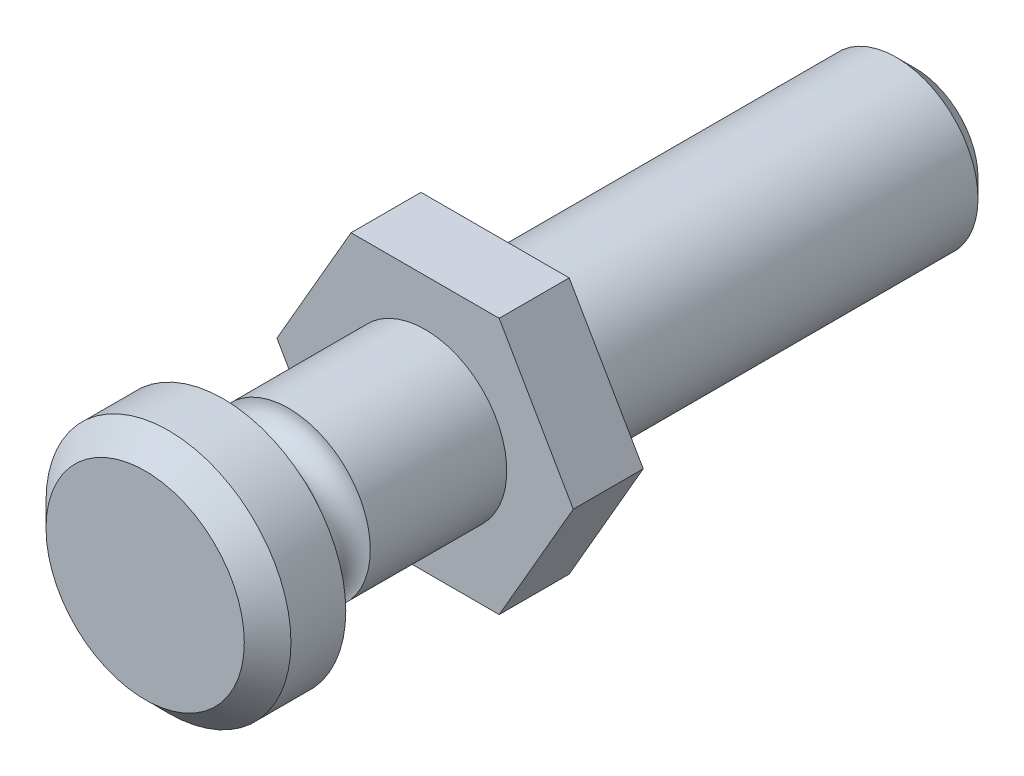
ISO-10303-21;
HEADER;
FILE_DESCRIPTION(('STEP AP214'),'2;1');
FILE_NAME('part.step','',(''),(''),'','','');
FILE_SCHEMA(('AUTOMOTIVE_DESIGN { 1 0 10303 214 1 1 1 1 }'));
ENDSEC;
DATA;
#1=APPLICATION_CONTEXT('core data for automotive mechanical design processes');
#2=APPLICATION_PROTOCOL_DEFINITION('international standard','automotive_design',2000,#1);
#3=PRODUCT_CONTEXT('',#1,'mechanical');
#4=PRODUCT('Part','Part','',(#3));
#5=PRODUCT_RELATED_PRODUCT_CATEGORY('part','',(#4));
#6=PRODUCT_DEFINITION_FORMATION('','',#4);
#7=PRODUCT_DEFINITION_CONTEXT('part definition',#1,'design');
#8=PRODUCT_DEFINITION('design','',#6,#7);
#9=PRODUCT_DEFINITION_SHAPE('','',#8);
#10=(LENGTH_UNIT() NAMED_UNIT(*) SI_UNIT(.MILLI.,.METRE.));
#11=(NAMED_UNIT(*) PLANE_ANGLE_UNIT() SI_UNIT($,.RADIAN.));
#12=(NAMED_UNIT(*) SI_UNIT($,.STERADIAN.) SOLID_ANGLE_UNIT());
#13=UNCERTAINTY_MEASURE_WITH_UNIT(LENGTH_MEASURE(1.E-05),#10,'distance_accuracy_value','');
#14=(GEOMETRIC_REPRESENTATION_CONTEXT(3) GLOBAL_UNCERTAINTY_ASSIGNED_CONTEXT((#13)) GLOBAL_UNIT_ASSIGNED_CONTEXT((#10,
#11,#12)) REPRESENTATION_CONTEXT('',''));
#15=CARTESIAN_POINT('',(0.,0.,0.));
#16=DIRECTION('',(0.,0.,1.));
#17=DIRECTION('',(1.,0.,0.));
#18=AXIS2_PLACEMENT_3D('',#15,#16,#17);
#19=CARTESIAN_POINT('',(2.22044604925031E-13,2.22044604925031E-13,33.9999999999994));
#20=DIRECTION('',(0.,0.,-0.999999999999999));
#21=DIRECTION('',(-1.,0.,0.));
#22=AXIS2_PLACEMENT_3D('',#19,#20,#21);
#23=CYLINDRICAL_SURFACE('',#22,5.25);
#24=CARTESIAN_POINT('',(1.66533453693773E-13,0.,32.));
#25=DIRECTION('',(0.,0.,0.999999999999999));
#26=DIRECTION('',(1.,0.,0.));
#27=AXIS2_PLACEMENT_3D('',#24,#25,#26);
#28=CIRCLE('',#27,5.25);
#29=CARTESIAN_POINT('',(-5.24999999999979,2.21642149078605E-13,32.));
#30=VERTEX_POINT('',#29);
#31=EDGE_CURVE('E11',#30,#30,#28,.F.);
#32=CARTESIAN_POINT('',(0.,-2.22044604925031E-13,29.6499999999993));
#33=DIRECTION('',(0.,0.,0.999999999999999));
#34=DIRECTION('',(1.,0.,0.));
#35=AXIS2_PLACEMENT_3D('',#32,#33,#34);
#36=CIRCLE('',#35,5.25);
#37=CARTESIAN_POINT('',(-5.24999999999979,2.21511697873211E-13,29.6499999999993));
#38=VERTEX_POINT('',#37);
#39=EDGE_CURVE('E250',#38,#38,#36,.T.);
#40=CARTESIAN_POINT('',(-5.24999999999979,2.21642149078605E-13,32.));
#41=CARTESIAN_POINT('',(-5.24999999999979,2.21640790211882E-13,31.9755208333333));
#42=CARTESIAN_POINT('',(-5.24999999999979,2.21639431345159E-13,31.9510416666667));
#43=CARTESIAN_POINT('',(-5.24999999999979,2.21636713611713E-13,31.9020833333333));
#44=CARTESIAN_POINT('',(-5.24999999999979,2.2163535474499E-13,31.8776041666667));
#45=CARTESIAN_POINT('',(-5.24999999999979,2.21632637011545E-13,31.8286458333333));
#46=CARTESIAN_POINT('',(-5.24999999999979,2.21631278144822E-13,31.8041666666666));
#47=CARTESIAN_POINT('',(-5.24999999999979,2.21628560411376E-13,31.7552083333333));
#48=CARTESIAN_POINT('',(-5.24999999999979,2.21627201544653E-13,31.7307291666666));
#49=CARTESIAN_POINT('',(-5.24999999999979,2.21624483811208E-13,31.6817708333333));
#50=CARTESIAN_POINT('',(-5.24999999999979,2.21623124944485E-13,31.6572916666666));
#51=CARTESIAN_POINT('',(-5.24999999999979,2.21620407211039E-13,31.6083333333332));
#52=CARTESIAN_POINT('',(-5.24999999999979,2.21619048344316E-13,31.5838541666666));
#53=CARTESIAN_POINT('',(-5.24999999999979,2.21616330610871E-13,31.5348958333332));
#54=CARTESIAN_POINT('',(-5.24999999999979,2.21614971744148E-13,31.5104166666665));
#55=CARTESIAN_POINT('',(-5.24999999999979,2.21612254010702E-13,31.4614583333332));
#56=CARTESIAN_POINT('',(-5.24999999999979,2.21610895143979E-13,31.4369791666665));
#57=CARTESIAN_POINT('',(-5.24999999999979,2.21608177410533E-13,31.3880208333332));
#58=CARTESIAN_POINT('',(-5.24999999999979,2.21606818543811E-13,31.3635416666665));
#59=CARTESIAN_POINT('',(-5.24999999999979,2.21604100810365E-13,31.3145833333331));
#60=CARTESIAN_POINT('',(-5.24999999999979,2.21602741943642E-13,31.2901041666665));
#61=CARTESIAN_POINT('',(-5.24999999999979,2.21600024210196E-13,31.2411458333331));
#62=CARTESIAN_POINT('',(-5.24999999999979,2.21598665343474E-13,31.2166666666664));
#63=CARTESIAN_POINT('',(-5.24999999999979,2.21595947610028E-13,31.1677083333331));
#64=CARTESIAN_POINT('',(-5.24999999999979,2.21594588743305E-13,31.1432291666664));
#65=CARTESIAN_POINT('',(-5.24999999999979,2.21591871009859E-13,31.0942708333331));
#66=CARTESIAN_POINT('',(-5.24999999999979,2.21590512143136E-13,31.0697916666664));
#67=CARTESIAN_POINT('',(-5.24999999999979,2.21587794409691E-13,31.0208333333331));
#68=CARTESIAN_POINT('',(-5.24999999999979,2.21586435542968E-13,30.9963541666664));
#69=CARTESIAN_POINT('',(-5.24999999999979,2.21583717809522E-13,30.947395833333));
#70=CARTESIAN_POINT('',(-5.24999999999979,2.21582358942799E-13,30.9229166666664));
#71=CARTESIAN_POINT('',(-5.24999999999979,2.21579641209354E-13,30.873958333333));
#72=CARTESIAN_POINT('',(-5.24999999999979,2.21578282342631E-13,30.8494791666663));
#73=CARTESIAN_POINT('',(-5.24999999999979,2.21575564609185E-13,30.800520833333));
#74=CARTESIAN_POINT('',(-5.24999999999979,2.21574205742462E-13,30.7760416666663));
#75=CARTESIAN_POINT('',(-5.24999999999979,2.21571488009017E-13,30.727083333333));
#76=CARTESIAN_POINT('',(-5.24999999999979,2.21570129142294E-13,30.7026041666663));
#77=CARTESIAN_POINT('',(-5.24999999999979,2.21567411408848E-13,30.6536458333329));
#78=CARTESIAN_POINT('',(-5.24999999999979,2.21566052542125E-13,30.6291666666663));
#79=CARTESIAN_POINT('',(-5.24999999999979,2.21563334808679E-13,30.5802083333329));
#80=CARTESIAN_POINT('',(-5.24999999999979,2.21561975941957E-13,30.5557291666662));
#81=CARTESIAN_POINT('',(-5.24999999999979,2.21559258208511E-13,30.5067708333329));
#82=CARTESIAN_POINT('',(-5.24999999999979,2.21557899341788E-13,30.4822916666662));
#83=CARTESIAN_POINT('',(-5.24999999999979,2.21555181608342E-13,30.4333333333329));
#84=CARTESIAN_POINT('',(-5.24999999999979,2.2155382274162E-13,30.4088541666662));
#85=CARTESIAN_POINT('',(-5.24999999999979,2.21551105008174E-13,30.3598958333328));
#86=CARTESIAN_POINT('',(-5.24999999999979,2.21549746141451E-13,30.3354166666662));
#87=CARTESIAN_POINT('',(-5.24999999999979,2.21547028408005E-13,30.2864583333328));
#88=CARTESIAN_POINT('',(-5.24999999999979,2.21545669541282E-13,30.2619791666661));
#89=CARTESIAN_POINT('',(-5.24999999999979,2.21542951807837E-13,30.2130208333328));
#90=CARTESIAN_POINT('',(-5.24999999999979,2.21541592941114E-13,30.1885416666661));
#91=CARTESIAN_POINT('',(-5.24999999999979,2.21538875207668E-13,30.1395833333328));
#92=CARTESIAN_POINT('',(-5.24999999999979,2.21537516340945E-13,30.1151041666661));
#93=CARTESIAN_POINT('',(-5.24999999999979,2.215347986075E-13,30.0661458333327));
#94=CARTESIAN_POINT('',(-5.24999999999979,2.21533439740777E-13,30.0416666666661));
#95=CARTESIAN_POINT('',(-5.24999999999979,2.21530722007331E-13,29.9927083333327));
#96=CARTESIAN_POINT('',(-5.24999999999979,2.21529363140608E-13,29.9682291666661));
#97=CARTESIAN_POINT('',(-5.24999999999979,2.21526645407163E-13,29.9192708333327));
#98=CARTESIAN_POINT('',(-5.24999999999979,2.2152528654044E-13,29.894791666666));
#99=CARTESIAN_POINT('',(-5.24999999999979,2.21522568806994E-13,29.8458333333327));
#100=CARTESIAN_POINT('',(-5.24999999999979,2.21521209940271E-13,29.821354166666));
#101=CARTESIAN_POINT('',(-5.24999999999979,2.21518492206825E-13,29.7723958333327));
#102=CARTESIAN_POINT('',(-5.24999999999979,2.21517133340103E-13,29.747916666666));
#103=CARTESIAN_POINT('',(-5.24999999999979,2.21514415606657E-13,29.6989583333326));
#104=CARTESIAN_POINT('',(-5.24999999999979,2.21513056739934E-13,29.674479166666));
#105=CARTESIAN_POINT('',(-5.24999999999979,2.21511697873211E-13,29.6499999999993));
#106=B_SPLINE_CURVE_WITH_KNOTS('',3,(#40,#41,#42,#43,#44,#45,#46,#47,#48,#49,#50,#51,#52,#53,
#54,#55,#56,#57,#58,#59,#60,#61,#62,#63,#64,#65,#66,#67,#68,#69,#70,#71,#72,#73,#74,#75,#76,#77,
#78,#79,#80,#81,#82,#83,#84,#85,#86,#87,#88,#89,#90,#91,#92,#93,#94,#95,#96,#97,#98,#99,#100,
#101,#102,#103,#104,#105),.UNSPECIFIED.,.F.,.F.,(4,2,2,2,2,2,2,2,2,2,2,2,2,2,2,2,2,2,2,2,2,2,2,
2,2,2,2,2,2,2,2,2,4),(0.,0.0734375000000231,0.146875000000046,0.220312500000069,
0.293750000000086,0.367187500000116,0.440625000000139,0.514062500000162,0.587500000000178,
0.660937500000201,0.734375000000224,0.807812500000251,0.881250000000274,0.954687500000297,
1.02812500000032,1.10156250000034,1.17500000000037,1.24843750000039,1.32187500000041,
1.39531250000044,1.46875000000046,1.54218750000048,1.61562500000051,1.68906250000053,
1.76250000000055,1.83593750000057,1.9093750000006,1.98281250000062,2.05625000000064,
2.12968750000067,2.20312500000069,2.27656250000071,2.35000000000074),.UNSPECIFIED.);
#107=EDGE_CURVE('BSEAM36',#30,#38,#106,.T.);
#108=ORIENTED_EDGE('',*,*,#31,.T.);
#109=ORIENTED_EDGE('',*,*,#39,.T.);
#110=ORIENTED_EDGE('',*,*,#107,.T.);
#111=ORIENTED_EDGE('',*,*,#107,.F.);
#112=EDGE_LOOP('',(#108,#110,#109,#111));
#113=FACE_BOUND('',#112,.T.);
#114=ADVANCED_FACE('F36',(#113),#23,.T.);
#115=CARTESIAN_POINT('',(3.1754264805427,-5.49999999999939,21.0000000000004));
#116=DIRECTION('',(0.,0.,-0.999999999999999));
#117=DIRECTION('',(-1.,0.,0.));
#118=AXIS2_PLACEMENT_3D('',#115,#116,#117);
#119=PLANE('',#118);
#120=DIRECTION('',(0.500000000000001,0.86602540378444,0.));
#121=VECTOR('',#120,1.);
#122=CARTESIAN_POINT('',(3.1754264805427,-5.49999999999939,21.0000000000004));
#123=LINE('',#122,#121);
#124=CARTESIAN_POINT('',(3.1754264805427,-5.49999999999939,21.0000000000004));
#125=VERTEX_POINT('',#124);
#126=CARTESIAN_POINT('',(6.35085296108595,0.,21.0000000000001));
#127=VERTEX_POINT('',#126);
#128=EDGE_CURVE('E128',#125,#127,#123,.T.);
#129=ORIENTED_EDGE('',*,*,#128,.T.);
#130=DIRECTION('',(-0.500000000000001,0.86602540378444,0.));
#131=VECTOR('',#130,1.);
#132=CARTESIAN_POINT('',(6.35085296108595,0.,21.0000000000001));
#133=LINE('',#132,#131);
#134=CARTESIAN_POINT('',(3.17542648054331,5.49999999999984,21.0000000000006));
#135=VERTEX_POINT('',#134);
#136=EDGE_CURVE('E105',#127,#135,#133,.T.);
#137=ORIENTED_EDGE('',*,*,#136,.T.);
#138=DIRECTION('',(-1.,0.,0.));
#139=VECTOR('',#138,1.);
#140=CARTESIAN_POINT('',(3.17542648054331,5.49999999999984,21.0000000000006));
#141=LINE('',#140,#139);
#142=CARTESIAN_POINT('',(-3.17542648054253,5.50000000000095,21.0000000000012));
#143=VERTEX_POINT('',#142);
#144=EDGE_CURVE('E131',#135,#143,#141,.T.);
#145=ORIENTED_EDGE('',*,*,#144,.T.);
#146=DIRECTION('',(-0.500000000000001,-0.86602540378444,0.));
#147=VECTOR('',#146,1.);
#148=CARTESIAN_POINT('',(-3.17542648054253,5.50000000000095,21.0000000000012));
#149=LINE('',#148,#147);
#150=CARTESIAN_POINT('',(-6.35085296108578,0.,20.9999999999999));
#151=VERTEX_POINT('',#150);
#152=EDGE_CURVE('E133',#143,#151,#149,.T.);
#153=ORIENTED_EDGE('',*,*,#152,.T.);
#154=DIRECTION('',(0.500000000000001,-0.86602540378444,0.));
#155=VECTOR('',#154,1.);
#156=CARTESIAN_POINT('',(-6.35085296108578,0.,20.9999999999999));
#157=LINE('',#156,#155);
#158=CARTESIAN_POINT('',(-3.17542648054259,-5.49999999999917,20.9999999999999));
#159=VERTEX_POINT('',#158);
#160=EDGE_CURVE('E56',#151,#159,#157,.T.);
#161=ORIENTED_EDGE('',*,*,#160,.T.);
#162=DIRECTION('',(1.,0.,0.));
#163=VECTOR('',#162,1.);
#164=CARTESIAN_POINT('',(-3.17542648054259,-5.49999999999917,20.9999999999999));
#165=LINE('',#164,#163);
#166=EDGE_CURVE('E51',#159,#125,#165,.T.);
#167=ORIENTED_EDGE('',*,*,#166,.T.);
#168=EDGE_LOOP('',(#129,#137,#145,#153,#161,#167));
#169=FACE_BOUND('',#168,.T.);
#170=CARTESIAN_POINT('',(3.88578058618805E-13,4.44089209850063E-13,21.0000000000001));
#171=DIRECTION('',(0.,0.,-0.999999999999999));
#172=DIRECTION('',(-1.,0.,0.));
#173=AXIS2_PLACEMENT_3D('',#170,#171,#172);
#174=CIRCLE('',#173,3.5);
#175=CARTESIAN_POINT('',(-3.4999999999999,0.,21.0000000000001));
#176=VERTEX_POINT('',#175);
#177=EDGE_CURVE('E150',#176,#176,#174,.F.);
#178=ORIENTED_EDGE('',*,*,#177,.F.);
#179=EDGE_LOOP('',(#178));
#180=FACE_BOUND('',#179,.T.);
#181=ADVANCED_FACE('F178',(#169,#180),#119,.F.);
#182=CARTESIAN_POINT('',(0.,0.,18.0000000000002));
#183=DIRECTION('',(0.,0.,-0.999999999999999));
#184=DIRECTION('',(-1.,0.,0.));
#185=AXIS2_PLACEMENT_3D('',#182,#183,#184);
#186=CYLINDRICAL_SURFACE('',#185,3.5);
#187=CARTESIAN_POINT('',(-1.11022302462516E-13,2.22044604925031E-13,0.800000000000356));
#188=DIRECTION('',(0.,0.,0.999999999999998));
#189=DIRECTION('',(1.,0.,0.));
#190=AXIS2_PLACEMENT_3D('',#187,#188,#189);
#191=CIRCLE('',#190,3.5);
#192=CARTESIAN_POINT('',(-3.49999999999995,0.,0.800000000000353));
#193=VERTEX_POINT('',#192);
#194=EDGE_CURVE('E153',#193,#193,#191,.T.);
#195=CARTESIAN_POINT('',(0.,0.,18.0000000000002));
#196=DIRECTION('',(0.,0.,0.999999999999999));
#197=DIRECTION('',(1.,0.,0.));
#198=AXIS2_PLACEMENT_3D('',#195,#196,#197);
#199=CIRCLE('',#198,3.5);
#200=CARTESIAN_POINT('',(-3.49999999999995,0.,18.0000000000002));
#201=VERTEX_POINT('',#200);
#202=EDGE_CURVE('E108',#201,#201,#199,.T.);
#203=CARTESIAN_POINT('',(-3.49999999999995,0.,0.800000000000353));
#204=CARTESIAN_POINT('',(-3.49999999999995,0.,0.979166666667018));
#205=CARTESIAN_POINT('',(-3.49999999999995,0.,1.15833333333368));
#206=CARTESIAN_POINT('',(-3.49999999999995,0.,1.51666666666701));
#207=CARTESIAN_POINT('',(-3.49999999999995,0.,1.69583333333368));
#208=CARTESIAN_POINT('',(-3.49999999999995,0.,2.05416666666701));
#209=CARTESIAN_POINT('',(-3.49999999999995,0.,2.23333333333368));
#210=CARTESIAN_POINT('',(-3.49999999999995,0.,2.59166666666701));
#211=CARTESIAN_POINT('',(-3.49999999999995,0.,2.77083333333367));
#212=CARTESIAN_POINT('',(-3.49999999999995,0.,3.129166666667));
#213=CARTESIAN_POINT('',(-3.49999999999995,0.,3.30833333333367));
#214=CARTESIAN_POINT('',(-3.49999999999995,0.,3.666666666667));
#215=CARTESIAN_POINT('',(-3.49999999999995,0.,3.84583333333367));
#216=CARTESIAN_POINT('',(-3.49999999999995,0.,4.204166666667));
#217=CARTESIAN_POINT('',(-3.49999999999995,0.,4.38333333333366));
#218=CARTESIAN_POINT('',(-3.49999999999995,0.,4.74166666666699));
#219=CARTESIAN_POINT('',(-3.49999999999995,0.,4.92083333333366));
#220=CARTESIAN_POINT('',(-3.49999999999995,0.,5.27916666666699));
#221=CARTESIAN_POINT('',(-3.49999999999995,0.,5.45833333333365));
#222=CARTESIAN_POINT('',(-3.49999999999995,0.,5.81666666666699));
#223=CARTESIAN_POINT('',(-3.49999999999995,0.,5.99583333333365));
#224=CARTESIAN_POINT('',(-3.49999999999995,0.,6.35416666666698));
#225=CARTESIAN_POINT('',(-3.49999999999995,0.,6.53333333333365));
#226=CARTESIAN_POINT('',(-3.49999999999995,0.,6.89166666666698));
#227=CARTESIAN_POINT('',(-3.49999999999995,0.,7.07083333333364));
#228=CARTESIAN_POINT('',(-3.49999999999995,0.,7.42916666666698));
#229=CARTESIAN_POINT('',(-3.49999999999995,0.,7.60833333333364));
#230=CARTESIAN_POINT('',(-3.49999999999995,0.,7.96666666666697));
#231=CARTESIAN_POINT('',(-3.49999999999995,0.,8.14583333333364));
#232=CARTESIAN_POINT('',(-3.49999999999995,0.,8.50416666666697));
#233=CARTESIAN_POINT('',(-3.49999999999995,0.,8.68333333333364));
#234=CARTESIAN_POINT('',(-3.49999999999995,0.,9.04166666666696));
#235=CARTESIAN_POINT('',(-3.49999999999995,0.,9.22083333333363));
#236=CARTESIAN_POINT('',(-3.49999999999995,0.,9.57916666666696));
#237=CARTESIAN_POINT('',(-3.49999999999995,0.,9.75833333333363));
#238=CARTESIAN_POINT('',(-3.49999999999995,0.,10.116666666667));
#239=CARTESIAN_POINT('',(-3.49999999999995,0.,10.2958333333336));
#240=CARTESIAN_POINT('',(-3.49999999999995,0.,10.654166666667));
#241=CARTESIAN_POINT('',(-3.49999999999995,0.,10.8333333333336));
#242=CARTESIAN_POINT('',(-3.49999999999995,0.,11.191666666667));
#243=CARTESIAN_POINT('',(-3.49999999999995,0.,11.3708333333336));
#244=CARTESIAN_POINT('',(-3.49999999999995,0.,11.7291666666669));
#245=CARTESIAN_POINT('',(-3.49999999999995,0.,11.9083333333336));
#246=CARTESIAN_POINT('',(-3.49999999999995,0.,12.2666666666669));
#247=CARTESIAN_POINT('',(-3.49999999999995,0.,12.4458333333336));
#248=CARTESIAN_POINT('',(-3.49999999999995,0.,12.8041666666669));
#249=CARTESIAN_POINT('',(-3.49999999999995,0.,12.9833333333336));
#250=CARTESIAN_POINT('',(-3.49999999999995,0.,13.3416666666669));
#251=CARTESIAN_POINT('',(-3.49999999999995,0.,13.5208333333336));
#252=CARTESIAN_POINT('',(-3.49999999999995,0.,13.8791666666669));
#253=CARTESIAN_POINT('',(-3.49999999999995,0.,14.0583333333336));
#254=CARTESIAN_POINT('',(-3.49999999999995,0.,14.4166666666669));
#255=CARTESIAN_POINT('',(-3.49999999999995,0.,14.5958333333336));
#256=CARTESIAN_POINT('',(-3.49999999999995,0.,14.9541666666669));
#257=CARTESIAN_POINT('',(-3.49999999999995,0.,15.1333333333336));
#258=CARTESIAN_POINT('',(-3.49999999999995,0.,15.4916666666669));
#259=CARTESIAN_POINT('',(-3.49999999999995,0.,15.6708333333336));
#260=CARTESIAN_POINT('',(-3.49999999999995,0.,16.0291666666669));
#261=CARTESIAN_POINT('',(-3.49999999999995,0.,16.2083333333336));
#262=CARTESIAN_POINT('',(-3.49999999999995,0.,16.5666666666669));
#263=CARTESIAN_POINT('',(-3.49999999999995,0.,16.7458333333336));
#264=CARTESIAN_POINT('',(-3.49999999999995,0.,17.1041666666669));
#265=CARTESIAN_POINT('',(-3.49999999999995,0.,17.2833333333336));
#266=CARTESIAN_POINT('',(-3.49999999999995,0.,17.6416666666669));
#267=CARTESIAN_POINT('',(-3.49999999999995,0.,17.8208333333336));
#268=CARTESIAN_POINT('',(-3.49999999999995,0.,18.0000000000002));
#269=B_SPLINE_CURVE_WITH_KNOTS('',3,(#203,#204,#205,#206,#207,#208,#209,#210,#211,#212,#213,
#214,#215,#216,#217,#218,#219,#220,#221,#222,#223,#224,#225,#226,#227,#228,#229,#230,#231,#232,
#233,#234,#235,#236,#237,#238,#239,#240,#241,#242,#243,#244,#245,#246,#247,#248,#249,#250,#251,
#252,#253,#254,#255,#256,#257,#258,#259,#260,#261,#262,#263,#264,#265,#266,#267,#268),
.UNSPECIFIED.,.F.,.F.,(4,2,2,2,2,2,2,2,2,2,2,2,2,2,2,2,2,2,2,2,2,2,2,2,2,2,2,2,2,2,2,2,4),(0.,
0.537499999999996,1.07499999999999,1.61249999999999,2.14999999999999,2.68749999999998,
3.22499999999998,3.76249999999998,4.29999999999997,4.83749999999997,5.37499999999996,
5.91249999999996,6.44999999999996,6.98749999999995,7.52499999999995,8.06249999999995,
8.59999999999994,9.13749999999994,9.67499999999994,10.2124999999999,10.7499999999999,
11.2874999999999,11.8249999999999,12.3624999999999,12.8999999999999,13.4374999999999,
13.9749999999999,14.5124999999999,15.0499999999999,15.5874999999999,16.1249999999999,
16.6624999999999,17.1999999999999),.UNSPECIFIED.);
#270=EDGE_CURVE('BSEAM38',#193,#201,#269,.T.);
#271=ORIENTED_EDGE('',*,*,#194,.T.);
#272=ORIENTED_EDGE('',*,*,#202,.F.);
#273=ORIENTED_EDGE('',*,*,#270,.T.);
#274=ORIENTED_EDGE('',*,*,#270,.F.);
#275=EDGE_LOOP('',(#271,#273,#272,#274));
#276=FACE_BOUND('',#275,.T.);
#277=ADVANCED_FACE('F38',(#276),#186,.T.);
#278=CARTESIAN_POINT('',(0.,0.,0.));
#279=DIRECTION('',(0.,0.,0.999999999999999));
#280=DIRECTION('',(1.,0.,0.));
#281=AXIS2_PLACEMENT_3D('',#278,#279,#280);
#282=PLANE('',#281);
#283=CARTESIAN_POINT('',(0.,0.,0.));
#284=DIRECTION('',(0.,0.,0.999999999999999));
#285=DIRECTION('',(1.,0.,0.));
#286=AXIS2_PLACEMENT_3D('',#283,#284,#285);
#287=CIRCLE('',#286,2.7);
#288=CARTESIAN_POINT('',(2.69999999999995,0.,0.));
#289=VERTEX_POINT('',#288);
#290=EDGE_CURVE('E156',#289,#289,#287,.F.);
#291=ORIENTED_EDGE('',*,*,#290,.T.);
#292=EDGE_LOOP('',(#291));
#293=FACE_BOUND('',#292,.T.);
#294=ADVANCED_FACE('F208',(#293),#282,.F.);
#295=CARTESIAN_POINT('',(3.17542648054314,-5.49999999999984,17.9999999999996));
#296=DIRECTION('',(0.,0.,-0.999999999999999));
#297=DIRECTION('',(-1.,0.,0.));
#298=AXIS2_PLACEMENT_3D('',#295,#296,#297);
#299=PLANE('',#298);
#300=DIRECTION('',(0.500000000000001,0.86602540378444,0.));
#301=VECTOR('',#300,1.);
#302=CARTESIAN_POINT('',(3.17542648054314,-5.49999999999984,17.9999999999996));
#303=LINE('',#302,#301);
#304=CARTESIAN_POINT('',(3.17542648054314,-5.49999999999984,17.9999999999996));
#305=VERTEX_POINT('',#304);
#306=CARTESIAN_POINT('',(6.35085296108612,-1.11022302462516E-13,17.9999999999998));
#307=VERTEX_POINT('',#306);
#308=EDGE_CURVE('E95',#305,#307,#303,.T.);
#309=ORIENTED_EDGE('',*,*,#308,.F.);
#310=DIRECTION('',(1.,0.,0.));
#311=VECTOR('',#310,1.);
#312=CARTESIAN_POINT('',(-3.17542648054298,-5.49999999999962,17.9999999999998));
#313=LINE('',#312,#311);
#314=CARTESIAN_POINT('',(-3.17542648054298,-5.49999999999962,17.9999999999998));
#315=VERTEX_POINT('',#314);
#316=EDGE_CURVE('E126',#315,#305,#313,.T.);
#317=ORIENTED_EDGE('',*,*,#316,.F.);
#318=DIRECTION('',(0.500000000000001,-0.86602540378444,0.));
#319=VECTOR('',#318,1.);
#320=CARTESIAN_POINT('',(-6.35085296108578,-2.22044604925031E-13,17.9999999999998));
#321=LINE('',#320,#319);
#322=CARTESIAN_POINT('',(-6.35085296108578,-2.22044604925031E-13,17.9999999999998));
#323=VERTEX_POINT('',#322);
#324=EDGE_CURVE('E124',#323,#315,#321,.T.);
#325=ORIENTED_EDGE('',*,*,#324,.F.);
#326=DIRECTION('',(-0.500000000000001,-0.86602540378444,0.));
#327=VECTOR('',#326,1.);
#328=CARTESIAN_POINT('',(-3.17542648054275,5.50000000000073,18.0000000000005));
#329=LINE('',#328,#327);
#330=CARTESIAN_POINT('',(-3.17542648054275,5.50000000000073,18.0000000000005));
#331=VERTEX_POINT('',#330);
#332=EDGE_CURVE('E122',#331,#323,#329,.T.);
#333=ORIENTED_EDGE('',*,*,#332,.F.);
#334=DIRECTION('',(-1.,0.,0.));
#335=VECTOR('',#334,1.);
#336=CARTESIAN_POINT('',(3.17542648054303,5.50000000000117,18.0000000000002));
#337=LINE('',#336,#335);
#338=CARTESIAN_POINT('',(3.17542648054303,5.50000000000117,18.0000000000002));
#339=VERTEX_POINT('',#338);
#340=EDGE_CURVE('E97',#339,#331,#337,.T.);
#341=ORIENTED_EDGE('',*,*,#340,.F.);
#342=DIRECTION('',(-0.500000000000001,0.86602540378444,0.));
#343=VECTOR('',#342,1.);
#344=CARTESIAN_POINT('',(6.35085296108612,-1.11022302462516E-13,17.9999999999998));
#345=LINE('',#344,#343);
#346=EDGE_CURVE('E89',#307,#339,#345,.T.);
#347=ORIENTED_EDGE('',*,*,#346,.F.);
#348=EDGE_LOOP('',(#309,#317,#325,#333,#341,#347));
#349=FACE_BOUND('',#348,.T.);
#350=ORIENTED_EDGE('',*,*,#202,.T.);
#351=EDGE_LOOP('',(#350));
#352=FACE_BOUND('',#351,.T.);
#353=ADVANCED_FACE('F91',(#349,#352),#299,.T.);
#354=CARTESIAN_POINT('',(3.1754264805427,-5.49999999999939,21.0000000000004));
#355=DIRECTION('',(-0.866025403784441,0.5,0.));
#356=DIRECTION('',(-0.500000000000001,-0.86602540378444,0.));
#357=AXIS2_PLACEMENT_3D('',#354,#355,#356);
#358=PLANE('',#357);
#359=ORIENTED_EDGE('',*,*,#308,.T.);
#360=DIRECTION('',(0.,0.,-0.999999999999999));
#361=VECTOR('',#360,1.);
#362=CARTESIAN_POINT('',(6.35085296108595,0.,21.0000000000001));
#363=LINE('',#362,#361);
#364=EDGE_CURVE('E103',#127,#307,#363,.T.);
#365=ORIENTED_EDGE('',*,*,#364,.F.);
#366=ORIENTED_EDGE('',*,*,#128,.F.);
#367=DIRECTION('',(0.,0.,-0.999999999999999));
#368=VECTOR('',#367,1.);
#369=CARTESIAN_POINT('',(3.1754264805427,-5.49999999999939,21.0000000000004));
#370=LINE('',#369,#368);
#371=EDGE_CURVE('E113',#125,#305,#370,.T.);
#372=ORIENTED_EDGE('',*,*,#371,.T.);
#373=EDGE_LOOP('',(#359,#365,#366,#372));
#374=FACE_BOUND('',#373,.T.);
#375=ADVANCED_FACE('F112',(#374),#358,.F.);
#376=CARTESIAN_POINT('',(6.35085296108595,0.,21.0000000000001));
#377=DIRECTION('',(-0.866025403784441,-0.500000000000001,0.));
#378=DIRECTION('',(0.500000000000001,-0.86602540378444,0.));
#379=AXIS2_PLACEMENT_3D('',#376,#377,#378);
#380=PLANE('',#379);
#381=ORIENTED_EDGE('',*,*,#346,.T.);
#382=DIRECTION('',(0.,0.,-0.999999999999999));
#383=VECTOR('',#382,1.);
#384=CARTESIAN_POINT('',(3.17542648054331,5.49999999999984,21.0000000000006));
#385=LINE('',#384,#383);
#386=EDGE_CURVE('E109',#135,#339,#385,.T.);
#387=ORIENTED_EDGE('',*,*,#386,.F.);
#388=ORIENTED_EDGE('',*,*,#136,.F.);
#389=ORIENTED_EDGE('',*,*,#364,.T.);
#390=EDGE_LOOP('',(#381,#387,#388,#389));
#391=FACE_BOUND('',#390,.T.);
#392=ADVANCED_FACE('F104',(#391),#380,.F.);
#393=CARTESIAN_POINT('',(3.17542648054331,5.49999999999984,21.0000000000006));
#394=DIRECTION('',(0.,-1.,0.));
#395=DIRECTION('',(1.,0.,0.));
#396=AXIS2_PLACEMENT_3D('',#393,#394,#395);
#397=PLANE('',#396);
#398=ORIENTED_EDGE('',*,*,#340,.T.);
#399=DIRECTION('',(0.,0.,-0.999999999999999));
#400=VECTOR('',#399,1.);
#401=CARTESIAN_POINT('',(-3.17542648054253,5.50000000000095,21.0000000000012));
#402=LINE('',#401,#400);
#403=EDGE_CURVE('E144',#143,#331,#402,.T.);
#404=ORIENTED_EDGE('',*,*,#403,.F.);
#405=ORIENTED_EDGE('',*,*,#144,.F.);
#406=ORIENTED_EDGE('',*,*,#386,.T.);
#407=EDGE_LOOP('',(#398,#404,#405,#406));
#408=FACE_BOUND('',#407,.T.);
#409=ADVANCED_FACE('F220',(#408),#397,.F.);
#410=CARTESIAN_POINT('',(-3.17542648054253,5.50000000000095,21.0000000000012));
#411=DIRECTION('',(0.86602540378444,-0.5,0.));
#412=DIRECTION('',(0.500000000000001,0.86602540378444,0.));
#413=AXIS2_PLACEMENT_3D('',#410,#411,#412);
#414=PLANE('',#413);
#415=ORIENTED_EDGE('',*,*,#332,.T.);
#416=DIRECTION('',(0.,0.,-0.999999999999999));
#417=VECTOR('',#416,1.);
#418=CARTESIAN_POINT('',(-6.35085296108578,0.,20.9999999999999));
#419=LINE('',#418,#417);
#420=EDGE_CURVE('E141',#151,#323,#419,.T.);
#421=ORIENTED_EDGE('',*,*,#420,.F.);
#422=ORIENTED_EDGE('',*,*,#152,.F.);
#423=ORIENTED_EDGE('',*,*,#403,.T.);
#424=EDGE_LOOP('',(#415,#421,#422,#423));
#425=FACE_BOUND('',#424,.T.);
#426=ADVANCED_FACE('F216',(#425),#414,.F.);
#427=CARTESIAN_POINT('',(-6.35085296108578,0.,20.9999999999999));
#428=DIRECTION('',(0.866025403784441,0.500000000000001,0.));
#429=DIRECTION('',(-0.500000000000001,0.86602540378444,0.));
#430=AXIS2_PLACEMENT_3D('',#427,#428,#429);
#431=PLANE('',#430);
#432=ORIENTED_EDGE('',*,*,#324,.T.);
#433=DIRECTION('',(0.,0.,-0.999999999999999));
#434=VECTOR('',#433,1.);
#435=CARTESIAN_POINT('',(-3.17542648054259,-5.49999999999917,20.9999999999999));
#436=LINE('',#435,#434);
#437=EDGE_CURVE('E138',#159,#315,#436,.T.);
#438=ORIENTED_EDGE('',*,*,#437,.F.);
#439=ORIENTED_EDGE('',*,*,#160,.F.);
#440=ORIENTED_EDGE('',*,*,#420,.T.);
#441=EDGE_LOOP('',(#432,#438,#439,#440));
#442=FACE_BOUND('',#441,.T.);
#443=ADVANCED_FACE('F212',(#442),#431,.F.);
#444=CARTESIAN_POINT('',(-3.17542648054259,-5.49999999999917,20.9999999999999));
#445=DIRECTION('',(0.,1.,0.));
#446=DIRECTION('',(-1.,0.,0.));
#447=AXIS2_PLACEMENT_3D('',#444,#445,#446);
#448=PLANE('',#447);
#449=ORIENTED_EDGE('',*,*,#316,.T.);
#450=ORIENTED_EDGE('',*,*,#371,.F.);
#451=ORIENTED_EDGE('',*,*,#166,.F.);
#452=ORIENTED_EDGE('',*,*,#437,.T.);
#453=EDGE_LOOP('',(#449,#450,#451,#452));
#454=FACE_BOUND('',#453,.T.);
#455=ADVANCED_FACE('F205',(#454),#448,.F.);
#456=CARTESIAN_POINT('',(1.11022302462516E-13,0.,26.8499999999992));
#457=DIRECTION('',(0.,0.,-0.999999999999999));
#458=DIRECTION('',(-1.,0.,0.));
#459=AXIS2_PLACEMENT_3D('',#456,#457,#458);
#460=CYLINDRICAL_SURFACE('',#459,3.5);
#461=CARTESIAN_POINT('',(1.11022302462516E-13,0.,26.8499999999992));
#462=DIRECTION('',(0.,0.,0.999999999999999));
#463=DIRECTION('',(1.,0.,0.));
#464=AXIS2_PLACEMENT_3D('',#461,#462,#463);
#465=CIRCLE('',#464,3.5);
#466=CARTESIAN_POINT('',(-3.4999999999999,0.,26.8499999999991));
#467=VERTEX_POINT('',#466);
#468=EDGE_CURVE('E114',#467,#467,#465,.T.);
#469=CARTESIAN_POINT('',(-3.4999999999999,0.,26.8499999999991));
#470=CARTESIAN_POINT('',(-3.4999999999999,0.,26.7890624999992));
#471=CARTESIAN_POINT('',(-3.4999999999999,0.,26.7281249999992));
#472=CARTESIAN_POINT('',(-3.4999999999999,0.,26.6062499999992));
#473=CARTESIAN_POINT('',(-3.4999999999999,0.,26.5453124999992));
#474=CARTESIAN_POINT('',(-3.4999999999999,0.,26.4234374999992));
#475=CARTESIAN_POINT('',(-3.4999999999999,0.,26.3624999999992));
#476=CARTESIAN_POINT('',(-3.4999999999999,0.,26.2406249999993));
#477=CARTESIAN_POINT('',(-3.4999999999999,0.,26.1796874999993));
#478=CARTESIAN_POINT('',(-3.4999999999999,0.,26.0578124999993));
#479=CARTESIAN_POINT('',(-3.4999999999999,0.,25.9968749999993));
#480=CARTESIAN_POINT('',(-3.4999999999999,0.,25.8749999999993));
#481=CARTESIAN_POINT('',(-3.4999999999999,0.,25.8140624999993));
#482=CARTESIAN_POINT('',(-3.4999999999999,0.,25.6921874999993));
#483=CARTESIAN_POINT('',(-3.4999999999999,0.,25.6312499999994));
#484=CARTESIAN_POINT('',(-3.4999999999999,0.,25.5093749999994));
#485=CARTESIAN_POINT('',(-3.4999999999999,0.,25.4484374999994));
#486=CARTESIAN_POINT('',(-3.4999999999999,0.,25.3265624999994));
#487=CARTESIAN_POINT('',(-3.4999999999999,0.,25.2656249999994));
#488=CARTESIAN_POINT('',(-3.4999999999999,0.,25.1437499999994));
#489=CARTESIAN_POINT('',(-3.4999999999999,0.,25.0828124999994));
#490=CARTESIAN_POINT('',(-3.4999999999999,0.,24.9609374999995));
#491=CARTESIAN_POINT('',(-3.4999999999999,0.,24.8999999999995));
#492=CARTESIAN_POINT('',(-3.4999999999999,0.,24.7781249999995));
#493=CARTESIAN_POINT('',(-3.4999999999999,0.,24.7171874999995));
#494=CARTESIAN_POINT('',(-3.4999999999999,0.,24.5953124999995));
#495=CARTESIAN_POINT('',(-3.4999999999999,0.,24.5343749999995));
#496=CARTESIAN_POINT('',(-3.4999999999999,0.,24.4124999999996));
#497=CARTESIAN_POINT('',(-3.4999999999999,0.,24.3515624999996));
#498=CARTESIAN_POINT('',(-3.4999999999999,0.,24.2296874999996));
#499=CARTESIAN_POINT('',(-3.4999999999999,0.,24.1687499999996));
#500=CARTESIAN_POINT('',(-3.4999999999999,0.,24.0468749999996));
#501=CARTESIAN_POINT('',(-3.4999999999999,0.,23.9859374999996));
#502=CARTESIAN_POINT('',(-3.4999999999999,0.,23.8640624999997));
#503=CARTESIAN_POINT('',(-3.4999999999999,0.,23.8031249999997));
#504=CARTESIAN_POINT('',(-3.4999999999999,0.,23.6812499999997));
#505=CARTESIAN_POINT('',(-3.4999999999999,0.,23.6203124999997));
#506=CARTESIAN_POINT('',(-3.4999999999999,0.,23.4984374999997));
#507=CARTESIAN_POINT('',(-3.4999999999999,0.,23.4374999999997));
#508=CARTESIAN_POINT('',(-3.4999999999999,0.,23.3156249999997));
#509=CARTESIAN_POINT('',(-3.4999999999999,0.,23.2546874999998));
#510=CARTESIAN_POINT('',(-3.4999999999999,0.,23.1328124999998));
#511=CARTESIAN_POINT('',(-3.4999999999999,0.,23.0718749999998));
#512=CARTESIAN_POINT('',(-3.4999999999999,0.,22.9499999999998));
#513=CARTESIAN_POINT('',(-3.4999999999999,0.,22.8890624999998));
#514=CARTESIAN_POINT('',(-3.4999999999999,0.,22.7671874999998));
#515=CARTESIAN_POINT('',(-3.4999999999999,0.,22.7062499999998));
#516=CARTESIAN_POINT('',(-3.4999999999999,0.,22.5843749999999));
#517=CARTESIAN_POINT('',(-3.4999999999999,0.,22.5234374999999));
#518=CARTESIAN_POINT('',(-3.4999999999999,0.,22.4015624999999));
#519=CARTESIAN_POINT('',(-3.4999999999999,0.,22.3406249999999));
#520=CARTESIAN_POINT('',(-3.4999999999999,0.,22.2187499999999));
#521=CARTESIAN_POINT('',(-3.4999999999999,0.,22.1578124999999));
#522=CARTESIAN_POINT('',(-3.4999999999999,0.,22.0359375));
#523=CARTESIAN_POINT('',(-3.4999999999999,0.,21.975));
#524=CARTESIAN_POINT('',(-3.4999999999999,0.,21.853125));
#525=CARTESIAN_POINT('',(-3.4999999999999,0.,21.7921875));
#526=CARTESIAN_POINT('',(-3.4999999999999,0.,21.6703125));
#527=CARTESIAN_POINT('',(-3.4999999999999,0.,21.609375));
#528=CARTESIAN_POINT('',(-3.4999999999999,0.,21.4875));
#529=CARTESIAN_POINT('',(-3.4999999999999,0.,21.4265625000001));
#530=CARTESIAN_POINT('',(-3.4999999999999,0.,21.3046875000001));
#531=CARTESIAN_POINT('',(-3.4999999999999,0.,21.2437500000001));
#532=CARTESIAN_POINT('',(-3.4999999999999,0.,21.1218750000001));
#533=CARTESIAN_POINT('',(-3.4999999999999,0.,21.0609375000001));
#534=CARTESIAN_POINT('',(-3.4999999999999,0.,21.0000000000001));
#535=B_SPLINE_CURVE_WITH_KNOTS('',3,(#469,#470,#471,#472,#473,#474,#475,#476,#477,#478,#479,
#480,#481,#482,#483,#484,#485,#486,#487,#488,#489,#490,#491,#492,#493,#494,#495,#496,#497,#498,
#499,#500,#501,#502,#503,#504,#505,#506,#507,#508,#509,#510,#511,#512,#513,#514,#515,#516,#517,
#518,#519,#520,#521,#522,#523,#524,#525,#526,#527,#528,#529,#530,#531,#532,#533,#534),
.UNSPECIFIED.,.F.,.F.,(4,2,2,2,2,2,2,2,2,2,2,2,2,2,2,2,2,2,2,2,2,2,2,2,2,2,2,2,2,2,2,2,4),(0.,
0.182812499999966,0.365624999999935,0.548437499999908,0.731249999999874,0.914062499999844,
1.09687499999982,1.27968749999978,1.46249999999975,1.64531249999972,1.82812499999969,
2.01093749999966,2.19374999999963,2.3765624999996,2.55937499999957,2.74218749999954,
2.92499999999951,3.10781249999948,3.29062499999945,3.47343749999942,3.65624999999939,
3.83906249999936,4.02187499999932,4.20468749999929,4.38749999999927,4.57031249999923,
4.7531249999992,4.93593749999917,5.11874999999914,5.30156249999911,5.48437499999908,
5.66718749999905,5.84999999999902),.UNSPECIFIED.);
#536=EDGE_CURVE('BSEAM201',#467,#176,#535,.T.);
#537=ORIENTED_EDGE('',*,*,#468,.F.);
#538=ORIENTED_EDGE('',*,*,#177,.T.);
#539=ORIENTED_EDGE('',*,*,#536,.T.);
#540=ORIENTED_EDGE('',*,*,#536,.F.);
#541=EDGE_LOOP('',(#537,#539,#538,#540));
#542=FACE_BOUND('',#541,.T.);
#543=ADVANCED_FACE('F201',(#542),#460,.T.);
#544=CARTESIAN_POINT('',(0.,-2.22044604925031E-13,29.6499999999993));
#545=DIRECTION('',(0.,0.,-0.999999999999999));
#546=DIRECTION('',(-1.,0.,0.));
#547=AXIS2_PLACEMENT_3D('',#544,#545,#546);
#548=CYLINDRICAL_SURFACE('',#547,3.5);
#549=CARTESIAN_POINT('',(0.,-2.22044604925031E-13,29.6499999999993));
#550=DIRECTION('',(0.,0.,0.999999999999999));
#551=DIRECTION('',(1.,0.,0.));
#552=AXIS2_PLACEMENT_3D('',#549,#550,#551);
#553=CIRCLE('',#552,3.5);
#554=CARTESIAN_POINT('',(-3.49999999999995,-2.22238893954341E-13,29.6499999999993));
#555=VERTEX_POINT('',#554);
#556=EDGE_CURVE('E117',#555,#555,#553,.T.);
#557=CARTESIAN_POINT('',(3.88578058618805E-13,8.88178419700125E-13,28.6499999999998));
#558=DIRECTION('',(0.,0.,0.999999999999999));
#559=DIRECTION('',(1.,0.,0.));
#560=AXIS2_PLACEMENT_3D('',#557,#558,#559);
#561=CIRCLE('',#560,3.5);
#562=CARTESIAN_POINT('',(-3.49999999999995,-2.22294405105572E-13,28.6499999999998));
#563=VERTEX_POINT('',#562);
#564=EDGE_CURVE('E253',#563,#563,#561,.T.);
#565=CARTESIAN_POINT('',(-3.49999999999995,-2.22238893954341E-13,29.6499999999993));
#566=CARTESIAN_POINT('',(-3.49999999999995,-2.22239472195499E-13,29.6395833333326));
#567=CARTESIAN_POINT('',(-3.49999999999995,-2.22240050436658E-13,29.629166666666));
#568=CARTESIAN_POINT('',(-3.49999999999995,-2.22241206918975E-13,29.6083333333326));
#569=CARTESIAN_POINT('',(-3.49999999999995,-2.22241785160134E-13,29.597916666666));
#570=CARTESIAN_POINT('',(-3.49999999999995,-2.22242941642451E-13,29.5770833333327));
#571=CARTESIAN_POINT('',(-3.49999999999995,-2.2224351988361E-13,29.566666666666));
#572=CARTESIAN_POINT('',(-3.49999999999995,-2.22244676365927E-13,29.5458333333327));
#573=CARTESIAN_POINT('',(-3.49999999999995,-2.22245254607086E-13,29.535416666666));
#574=CARTESIAN_POINT('',(-3.49999999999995,-2.22246411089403E-13,29.5145833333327));
#575=CARTESIAN_POINT('',(-3.49999999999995,-2.22246989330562E-13,29.504166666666));
#576=CARTESIAN_POINT('',(-3.49999999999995,-2.22248145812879E-13,29.4833333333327));
#577=CARTESIAN_POINT('',(-3.49999999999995,-2.22248724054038E-13,29.4729166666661));
#578=CARTESIAN_POINT('',(-3.49999999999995,-2.22249880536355E-13,29.4520833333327));
#579=CARTESIAN_POINT('',(-3.49999999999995,-2.22250458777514E-13,29.4416666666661));
#580=CARTESIAN_POINT('',(-3.49999999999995,-2.22251615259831E-13,29.4208333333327));
#581=CARTESIAN_POINT('',(-3.49999999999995,-2.2225219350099E-13,29.4104166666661));
#582=CARTESIAN_POINT('',(-3.49999999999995,-2.22253349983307E-13,29.3895833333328));
#583=CARTESIAN_POINT('',(-3.49999999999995,-2.22253928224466E-13,29.3791666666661));
#584=CARTESIAN_POINT('',(-3.49999999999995,-2.22255084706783E-13,29.3583333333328));
#585=CARTESIAN_POINT('',(-3.49999999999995,-2.22255662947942E-13,29.3479166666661));
#586=CARTESIAN_POINT('',(-3.49999999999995,-2.22256819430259E-13,29.3270833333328));
#587=CARTESIAN_POINT('',(-3.49999999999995,-2.22257397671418E-13,29.3166666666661));
#588=CARTESIAN_POINT('',(-3.49999999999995,-2.22258554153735E-13,29.2958333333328));
#589=CARTESIAN_POINT('',(-3.49999999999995,-2.22259132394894E-13,29.2854166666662));
#590=CARTESIAN_POINT('',(-3.49999999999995,-2.22260288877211E-13,29.2645833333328));
#591=CARTESIAN_POINT('',(-3.49999999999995,-2.2226086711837E-13,29.2541666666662));
#592=CARTESIAN_POINT('',(-3.49999999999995,-2.22262023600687E-13,29.2333333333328));
#593=CARTESIAN_POINT('',(-3.49999999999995,-2.22262601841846E-13,29.2229166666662));
#594=CARTESIAN_POINT('',(-3.49999999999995,-2.22263758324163E-13,29.2020833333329));
#595=CARTESIAN_POINT('',(-3.49999999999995,-2.22264336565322E-13,29.1916666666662));
#596=CARTESIAN_POINT('',(-3.49999999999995,-2.22265493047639E-13,29.1708333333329));
#597=CARTESIAN_POINT('',(-3.49999999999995,-2.22266071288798E-13,29.1604166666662));
#598=CARTESIAN_POINT('',(-3.49999999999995,-2.22267227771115E-13,29.1395833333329));
#599=CARTESIAN_POINT('',(-3.49999999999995,-2.22267806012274E-13,29.1291666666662));
#600=CARTESIAN_POINT('',(-3.49999999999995,-2.22268962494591E-13,29.1083333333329));
#601=CARTESIAN_POINT('',(-3.49999999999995,-2.2226954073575E-13,29.0979166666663));
#602=CARTESIAN_POINT('',(-3.49999999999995,-2.22270697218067E-13,29.0770833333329));
#603=CARTESIAN_POINT('',(-3.49999999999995,-2.22271275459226E-13,29.0666666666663));
#604=CARTESIAN_POINT('',(-3.49999999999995,-2.22272431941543E-13,29.045833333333));
#605=CARTESIAN_POINT('',(-3.49999999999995,-2.22273010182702E-13,29.0354166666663));
#606=CARTESIAN_POINT('',(-3.49999999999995,-2.22274166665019E-13,29.014583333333));
#607=CARTESIAN_POINT('',(-3.49999999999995,-2.22274744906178E-13,29.0041666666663));
#608=CARTESIAN_POINT('',(-3.49999999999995,-2.22275901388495E-13,28.983333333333));
#609=CARTESIAN_POINT('',(-3.49999999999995,-2.22276479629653E-13,28.9729166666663));
#610=CARTESIAN_POINT('',(-3.49999999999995,-2.22277636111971E-13,28.952083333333));
#611=CARTESIAN_POINT('',(-3.49999999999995,-2.22278214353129E-13,28.9416666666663));
#612=CARTESIAN_POINT('',(-3.49999999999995,-2.22279370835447E-13,28.920833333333));
#613=CARTESIAN_POINT('',(-3.49999999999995,-2.22279949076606E-13,28.9104166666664));
#614=CARTESIAN_POINT('',(-3.49999999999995,-2.22281105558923E-13,28.889583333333));
#615=CARTESIAN_POINT('',(-3.49999999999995,-2.22281683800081E-13,28.8791666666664));
#616=CARTESIAN_POINT('',(-3.49999999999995,-2.22282840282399E-13,28.8583333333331));
#617=CARTESIAN_POINT('',(-3.49999999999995,-2.22283418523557E-13,28.8479166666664));
#618=CARTESIAN_POINT('',(-3.49999999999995,-2.22284575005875E-13,28.8270833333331));
#619=CARTESIAN_POINT('',(-3.49999999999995,-2.22285153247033E-13,28.8166666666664));
#620=CARTESIAN_POINT('',(-3.49999999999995,-2.22286309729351E-13,28.7958333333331));
#621=CARTESIAN_POINT('',(-3.49999999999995,-2.22286887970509E-13,28.7854166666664));
#622=CARTESIAN_POINT('',(-3.49999999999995,-2.22288044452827E-13,28.7645833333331));
#623=CARTESIAN_POINT('',(-3.49999999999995,-2.22288622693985E-13,28.7541666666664));
#624=CARTESIAN_POINT('',(-3.49999999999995,-2.22289779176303E-13,28.7333333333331));
#625=CARTESIAN_POINT('',(-3.49999999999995,-2.22290357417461E-13,28.7229166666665));
#626=CARTESIAN_POINT('',(-3.49999999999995,-2.22291513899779E-13,28.7020833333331));
#627=CARTESIAN_POINT('',(-3.49999999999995,-2.22292092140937E-13,28.6916666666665));
#628=CARTESIAN_POINT('',(-3.49999999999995,-2.22293248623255E-13,28.6708333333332));
#629=CARTESIAN_POINT('',(-3.49999999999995,-2.22293826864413E-13,28.6604166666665));
#630=CARTESIAN_POINT('',(-3.49999999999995,-2.22294405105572E-13,28.6499999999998));
#631=B_SPLINE_CURVE_WITH_KNOTS('',3,(#565,#566,#567,#568,#569,#570,#571,#572,#573,#574,#575,
#576,#577,#578,#579,#580,#581,#582,#583,#584,#585,#586,#587,#588,#589,#590,#591,#592,#593,#594,
#595,#596,#597,#598,#599,#600,#601,#602,#603,#604,#605,#606,#607,#608,#609,#610,#611,#612,#613,
#614,#615,#616,#617,#618,#619,#620,#621,#622,#623,#624,#625,#626,#627,#628,#629,#630),
.UNSPECIFIED.,.F.,.F.,(4,2,2,2,2,2,2,2,2,2,2,2,2,2,2,2,2,2,2,2,2,2,2,2,2,2,2,2,2,2,2,2,4),(0.,
0.0312499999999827,0.0624999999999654,0.093749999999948,0.124999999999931,0.156249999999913,
0.187499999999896,0.218749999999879,0.249999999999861,0.281249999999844,0.312499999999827,
0.343749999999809,0.374999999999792,0.406249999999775,0.437499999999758,0.46874999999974,
0.499999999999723,0.531249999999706,0.562499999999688,0.593749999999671,0.624999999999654,
0.656249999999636,0.687499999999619,0.718749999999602,0.749999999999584,0.781249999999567,
0.81249999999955,0.843749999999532,0.874999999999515,0.906249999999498,0.93749999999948,
0.968749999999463,0.999999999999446),.UNSPECIFIED.);
#632=EDGE_CURVE('BSEAM197',#555,#563,#631,.T.);
#633=ORIENTED_EDGE('',*,*,#556,.F.);
#634=ORIENTED_EDGE('',*,*,#564,.T.);
#635=ORIENTED_EDGE('',*,*,#632,.T.);
#636=ORIENTED_EDGE('',*,*,#632,.F.);
#637=EDGE_LOOP('',(#633,#635,#634,#636));
#638=FACE_BOUND('',#637,.T.);
#639=ADVANCED_FACE('F197',(#638),#548,.T.);
#640=CARTESIAN_POINT('',(0.,0.,27.7500000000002));
#641=DIRECTION('',(0.,0.,0.999999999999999));
#642=DIRECTION('',(1.,0.,0.));
#643=AXIS2_PLACEMENT_3D('',#640,#641,#642);
#644=TOROIDAL_SURFACE('',#643,3.5,0.9);
#645=ORIENTED_EDGE('',*,*,#564,.F.);
#646=EDGE_LOOP('',(#645));
#647=FACE_BOUND('',#646,.T.);
#648=CARTESIAN_POINT('',(0.,0.,27.7500000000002));
#649=DIRECTION('',(0.,0.,0.999999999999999));
#650=DIRECTION('',(1.,0.,0.));
#651=AXIS2_PLACEMENT_3D('',#648,#649,#650);
#652=CIRCLE('',#651,2.6);
#653=CARTESIAN_POINT('',(2.59999999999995,0.,27.7500000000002));
#654=VERTEX_POINT('',#653);
#655=EDGE_CURVE('E255',#654,#654,#652,.F.);
#656=ORIENTED_EDGE('',*,*,#655,.F.);
#657=EDGE_LOOP('',(#656));
#658=FACE_BOUND('',#657,.T.);
#659=ADVANCED_FACE('F193',(#647,#658),#644,.F.);
#660=CARTESIAN_POINT('',(0.,0.,27.7500000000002));
#661=DIRECTION('',(0.,0.,0.999999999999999));
#662=DIRECTION('',(1.,0.,0.));
#663=AXIS2_PLACEMENT_3D('',#660,#661,#662);
#664=TOROIDAL_SURFACE('',#663,3.5,0.9);
#665=ORIENTED_EDGE('',*,*,#468,.T.);
#666=EDGE_LOOP('',(#665));
#667=FACE_BOUND('',#666,.T.);
#668=ORIENTED_EDGE('',*,*,#655,.T.);
#669=EDGE_LOOP('',(#668));
#670=FACE_BOUND('',#669,.T.);
#671=ADVANCED_FACE('F190',(#667,#670),#664,.F.);
#672=CARTESIAN_POINT('',(0.,-2.22044604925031E-13,29.6499999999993));
#673=DIRECTION('',(0.,0.,0.999999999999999));
#674=DIRECTION('',(1.,0.,0.));
#675=AXIS2_PLACEMENT_3D('',#672,#673,#674);
#676=PLANE('',#675);
#677=ORIENTED_EDGE('',*,*,#39,.F.);
#678=EDGE_LOOP('',(#677));
#679=FACE_BOUND('',#678,.T.);
#680=ORIENTED_EDGE('',*,*,#556,.T.);
#681=EDGE_LOOP('',(#680));
#682=FACE_BOUND('',#681,.T.);
#683=ADVANCED_FACE('F188',(#679,#682),#676,.F.);
#684=CARTESIAN_POINT('',(-1.11022302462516E-13,2.22044604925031E-13,0.800000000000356));
#685=DIRECTION('',(0.,0.,0.999999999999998));
#686=DIRECTION('',(1.,0.,0.));
#687=AXIS2_PLACEMENT_3D('',#684,#685,#686);
#688=CONICAL_SURFACE('',#687,3.5,0.78539816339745);
#689=ORIENTED_EDGE('',*,*,#290,.F.);
#690=EDGE_LOOP('',(#689));
#691=FACE_BOUND('',#690,.T.);
#692=ORIENTED_EDGE('',*,*,#194,.F.);
#693=EDGE_LOOP('',(#692));
#694=FACE_BOUND('',#693,.T.);
#695=ADVANCED_FACE('F174',(#691,#694),#688,.T.);
#696=CARTESIAN_POINT('',(-2.22044604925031E-13,5.55111512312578E-13,32.999999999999));
#697=DIRECTION('',(0.,0.,0.999999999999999));
#698=DIRECTION('',(1.,0.,0.));
#699=AXIS2_PLACEMENT_3D('',#696,#697,#698);
#700=PLANE('',#699);
#701=CARTESIAN_POINT('',(-2.22044604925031E-13,5.55111512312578E-13,32.999999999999));
#702=DIRECTION('',(0.,0.,0.999999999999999));
#703=DIRECTION('',(1.,0.,0.));
#704=AXIS2_PLACEMENT_3D('',#701,#702,#703);
#705=CIRCLE('',#704,4.24999999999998);
#706=CARTESIAN_POINT('',(-4.25000000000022,5.54875589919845E-13,32.999999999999));
#707=VERTEX_POINT('',#706);
#708=EDGE_CURVE('E44',#707,#707,#705,.T.);
#709=ORIENTED_EDGE('',*,*,#708,.T.);
#710=EDGE_LOOP('',(#709));
#711=FACE_BOUND('',#710,.T.);
#712=ADVANCED_FACE('F165',(#711),#700,.T.);
#713=CARTESIAN_POINT('',(-2.22044604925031E-13,5.55111512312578E-13,32.999999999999));
#714=DIRECTION('',(0.,0.,-0.999999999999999));
#715=DIRECTION('',(-1.,0.,0.));
#716=AXIS2_PLACEMENT_3D('',#713,#714,#715);
#717=CONICAL_SURFACE('',#716,4.24999999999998,0.785398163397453);
#718=CARTESIAN_POINT('',(-5.24999999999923,5.54764567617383E-13,32.));
#719=CARTESIAN_POINT('',(-5.23958333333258,5.547657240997E-13,32.0104166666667));
#720=CARTESIAN_POINT('',(-5.22916666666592,5.54766880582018E-13,32.0208333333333));
#721=CARTESIAN_POINT('',(-5.20833333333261,5.54769193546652E-13,32.0416666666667));
#722=CARTESIAN_POINT('',(-5.19791666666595,5.5477035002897E-13,32.0520833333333));
#723=CARTESIAN_POINT('',(-5.17708333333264,5.54772662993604E-13,32.0729166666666));
#724=CARTESIAN_POINT('',(-5.16666666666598,5.54773819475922E-13,32.0833333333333));
#725=CARTESIAN_POINT('',(-5.14583333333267,5.54776132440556E-13,32.1041666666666));
#726=CARTESIAN_POINT('',(-5.13541666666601,5.54777288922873E-13,32.1145833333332));
#727=CARTESIAN_POINT('',(-5.1145833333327,5.54779601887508E-13,32.1354166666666));
#728=CARTESIAN_POINT('',(-5.10416666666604,5.54780758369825E-13,32.1458333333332));
#729=CARTESIAN_POINT('',(-5.08333333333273,5.5478307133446E-13,32.1666666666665));
#730=CARTESIAN_POINT('',(-5.07291666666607,5.54784227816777E-13,32.1770833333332));
#731=CARTESIAN_POINT('',(-5.05208333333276,5.54786540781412E-13,32.1979166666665));
#732=CARTESIAN_POINT('',(-5.0416666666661,5.54787697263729E-13,32.2083333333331));
#733=CARTESIAN_POINT('',(-5.02083333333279,5.54790010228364E-13,32.2291666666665));
#734=CARTESIAN_POINT('',(-5.01041666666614,5.54791166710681E-13,32.2395833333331));
#735=CARTESIAN_POINT('',(-4.98958333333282,5.54793479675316E-13,32.2604166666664));
#736=CARTESIAN_POINT('',(-4.97916666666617,5.54794636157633E-13,32.2708333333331));
#737=CARTESIAN_POINT('',(-4.95833333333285,5.54796949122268E-13,32.2916666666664));
#738=CARTESIAN_POINT('',(-4.9479166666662,5.54798105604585E-13,32.3020833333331));
#739=CARTESIAN_POINT('',(-4.92708333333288,5.5480041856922E-13,32.3229166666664));
#740=CARTESIAN_POINT('',(-4.91666666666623,5.54801575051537E-13,32.333333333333));
#741=CARTESIAN_POINT('',(-4.89583333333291,5.54803888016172E-13,32.3541666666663));
#742=CARTESIAN_POINT('',(-4.88541666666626,5.54805044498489E-13,32.364583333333));
#743=CARTESIAN_POINT('',(-4.86458333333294,5.54807357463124E-13,32.3854166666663));
#744=CARTESIAN_POINT('',(-4.85416666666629,5.54808513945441E-13,32.395833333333));
#745=CARTESIAN_POINT('',(-4.83333333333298,5.54810826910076E-13,32.4166666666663));
#746=CARTESIAN_POINT('',(-4.82291666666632,5.54811983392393E-13,32.4270833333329));
#747=CARTESIAN_POINT('',(-4.80208333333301,5.54814296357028E-13,32.4479166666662));
#748=CARTESIAN_POINT('',(-4.79166666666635,5.54815452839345E-13,32.4583333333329));
#749=CARTESIAN_POINT('',(-4.77083333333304,5.5481776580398E-13,32.4791666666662));
#750=CARTESIAN_POINT('',(-4.76041666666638,5.54818922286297E-13,32.4895833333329));
#751=CARTESIAN_POINT('',(-4.73958333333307,5.54821235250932E-13,32.5104166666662));
#752=CARTESIAN_POINT('',(-4.72916666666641,5.54822391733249E-13,32.5208333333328));
#753=CARTESIAN_POINT('',(-4.7083333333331,5.54824704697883E-13,32.5416666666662));
#754=CARTESIAN_POINT('',(-4.69791666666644,5.54825861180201E-13,32.5520833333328));
#755=CARTESIAN_POINT('',(-4.67708333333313,5.54828174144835E-13,32.5729166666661));
#756=CARTESIAN_POINT('',(-4.66666666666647,5.54829330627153E-13,32.5833333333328));
#757=CARTESIAN_POINT('',(-4.64583333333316,5.54831643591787E-13,32.6041666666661));
#758=CARTESIAN_POINT('',(-4.6354166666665,5.54832800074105E-13,32.6145833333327));
#759=CARTESIAN_POINT('',(-4.61458333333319,5.54835113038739E-13,32.6354166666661));
#760=CARTESIAN_POINT('',(-4.60416666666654,5.54836269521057E-13,32.6458333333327));
#761=CARTESIAN_POINT('',(-4.58333333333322,5.54838582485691E-13,32.666666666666));
#762=CARTESIAN_POINT('',(-4.57291666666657,5.54839738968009E-13,32.6770833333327));
#763=CARTESIAN_POINT('',(-4.55208333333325,5.54842051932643E-13,32.697916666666));
#764=CARTESIAN_POINT('',(-4.5416666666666,5.5484320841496E-13,32.7083333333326));
#765=CARTESIAN_POINT('',(-4.52083333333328,5.54845521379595E-13,32.729166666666));
#766=CARTESIAN_POINT('',(-4.51041666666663,5.54846677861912E-13,32.7395833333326));
#767=CARTESIAN_POINT('',(-4.48958333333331,5.54848990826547E-13,32.7604166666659));
#768=CARTESIAN_POINT('',(-4.47916666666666,5.54850147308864E-13,32.7708333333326));
#769=CARTESIAN_POINT('',(-4.45833333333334,5.54852460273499E-13,32.7916666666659));
#770=CARTESIAN_POINT('',(-4.44791666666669,5.54853616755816E-13,32.8020833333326));
#771=CARTESIAN_POINT('',(-4.42708333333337,5.54855929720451E-13,32.8229166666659));
#772=CARTESIAN_POINT('',(-4.41666666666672,5.54857086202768E-13,32.8333333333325));
#773=CARTESIAN_POINT('',(-4.39583333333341,5.54859399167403E-13,32.8541666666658));
#774=CARTESIAN_POINT('',(-4.38541666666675,5.5486055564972E-13,32.8645833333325));
#775=CARTESIAN_POINT('',(-4.36458333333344,5.54862868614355E-13,32.8854166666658));
#776=CARTESIAN_POINT('',(-4.35416666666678,5.54864025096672E-13,32.8958333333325));
#777=CARTESIAN_POINT('',(-4.33333333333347,5.54866338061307E-13,32.9166666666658));
#778=CARTESIAN_POINT('',(-4.32291666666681,5.54867494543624E-13,32.9270833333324));
#779=CARTESIAN_POINT('',(-4.3020833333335,5.54869807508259E-13,32.9479166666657));
#780=CARTESIAN_POINT('',(-4.29166666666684,5.54870963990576E-13,32.9583333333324));
#781=CARTESIAN_POINT('',(-4.27083333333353,5.54873276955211E-13,32.9791666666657));
#782=CARTESIAN_POINT('',(-4.26041666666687,5.54874433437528E-13,32.9895833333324));
#783=CARTESIAN_POINT('',(-4.25000000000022,5.54875589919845E-13,32.999999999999));
#784=B_SPLINE_CURVE_WITH_KNOTS('',3,(#718,#719,#720,#721,#722,#723,#724,#725,#726,#727,#728,
#729,#730,#731,#732,#733,#734,#735,#736,#737,#738,#739,#740,#741,#742,#743,#744,#745,#746,#747,
#748,#749,#750,#751,#752,#753,#754,#755,#756,#757,#758,#759,#760,#761,#762,#763,#764,#765,#766,
#767,#768,#769,#770,#771,#772,#773,#774,#775,#776,#777,#778,#779,#780,#781,#782,#783),
.UNSPECIFIED.,.F.,.F.,(4,2,2,2,2,2,2,2,2,2,2,2,2,2,2,2,2,2,2,2,2,2,2,2,2,2,2,2,2,2,2,2,4),(0.,
0.0441941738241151,0.0883883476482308,0.132582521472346,0.176776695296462,0.220970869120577,
0.265165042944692,0.309359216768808,0.353553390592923,0.397747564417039,0.441941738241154,
0.48613591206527,0.530330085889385,0.5745242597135,0.618718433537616,0.662912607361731,
0.707106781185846,0.751300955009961,0.795495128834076,0.839689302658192,0.883883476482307,
0.928077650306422,0.972271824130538,1.01646599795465,1.06066017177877,1.10485434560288,
1.149048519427,1.19324269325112,1.23743686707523,1.28163104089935,1.32582521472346,
1.37001938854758,1.4142135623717),.UNSPECIFIED.);
#785=EDGE_CURVE('BSEAM167',#30,#707,#784,.T.);
#786=ORIENTED_EDGE('',*,*,#31,.F.);
#787=ORIENTED_EDGE('',*,*,#708,.F.);
#788=ORIENTED_EDGE('',*,*,#785,.T.);
#789=ORIENTED_EDGE('',*,*,#785,.F.);
#790=EDGE_LOOP('',(#786,#788,#787,#789));
#791=FACE_BOUND('',#790,.T.);
#792=ADVANCED_FACE('F167',(#791),#717,.T.);
#793=CLOSED_SHELL('',(#114,#181,#277,#294,#353,#375,#392,#409,#426,#443,#455,#543,#639,#659,
#671,#683,#695,#712,#792));
#794=MANIFOLD_SOLID_BREP('B2',#793);
#795=ADVANCED_BREP_SHAPE_REPRESENTATION('',(#18,#794),#14);
#796=SHAPE_DEFINITION_REPRESENTATION(#9,#795);
ENDSEC;
END-ISO-10303-21;
